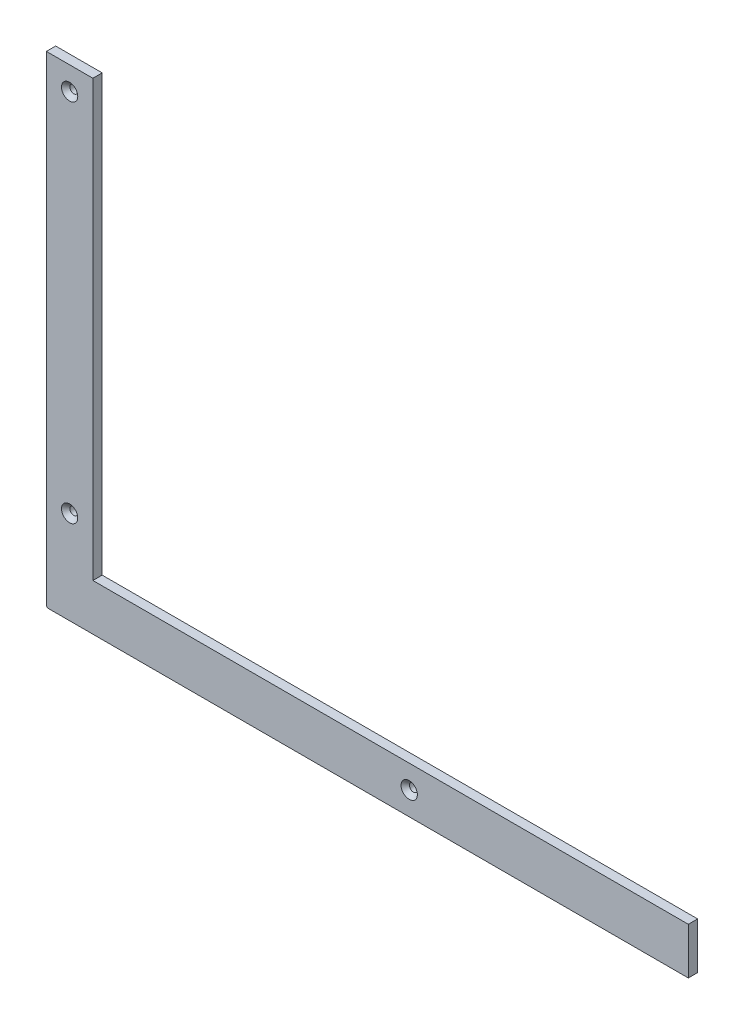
from build123d import *

# Parameters (mm, degrees)
SKIZZE1_W                                            = 532
SKIZZE1_H                                            = 394
SKIZZE1_W_2                                          = 492
SKIZZE1_H_2                                          = 354
AUFSATZ_LINEAR_AUSTRAGEN1_DEPTH                      = 8
VERRUNDUNG1_R                                        = 1
SKIZZE2_W                                            = 517
SKIZZE2_H                                            = 379
SCHNITT_LINEAR_AUSTRAGEN1_DEPTH                      = 4
FORMSENKUNG_F_R_M3_SENKSCHRAUBE_MIT_INNE_D           = 3.4
FORMSENKUNG_F_R_M3_SENKSCHRAUBE_MIT_INNE_CSINK_D     = 7
FORMSENKUNG_F_R_M3_SENKSCHRAUBE_MIT_INNE_CSINK_ANGLE = 90
SCHNITT_LINEAR_AUSTRAGEN2_DEPTH                      = 332.1027031
SCHNITT_LINEAR_AUSTRAGEN3_DEPTH                      = 332.1027031
SCHNITT_LINEAR_AUSTRAGEN4_DEPTH                      = 332.1027031
SCHNITT_LINEAR_AUSTRAGEN4_DEPTH_BACK                 = 332.1027031


with BuildPart() as part:
    # Skizze1 → Aufsatz-Linear austragen1 (new body)
    with BuildSketch(Plane.XY):
        Rectangle(SKIZZE1_W, SKIZZE1_H)
        Rectangle(SKIZZE1_W_2, SKIZZE1_H_2, mode=Mode.SUBTRACT)
    extrude(amount=AUFSATZ_LINEAR_AUSTRAGEN1_DEPTH)

    # Verrundung1
    verrundung1_edges = [part.edges().sort_by_distance(p)[0] for p in [
        (266, -197, 4),
        (-266, -197, 4),
        (-266, 197, 4),
        (266, 197, 4),
    ]]
    fillet(verrundung1_edges, radius=VERRUNDUNG1_R)

    # Skizze2 → Schnitt-Linear austragen1 (cut)
    with BuildSketch(Plane(origin=(0, 0, 0), x_dir=(-1, 0, 0), z_dir=(0, 0, -1))):
        Rectangle(SKIZZE2_W, SKIZZE2_H)
    extrude(amount=-SCHNITT_LINEAR_AUSTRAGEN1_DEPTH, mode=Mode.SUBTRACT)

    # Formsenkung f_r M3 Senkschraube mit Inne (through all)
    with Locations(Plane.XY.offset(8)):
        with Locations((-110, -187), (110, -187), (110, 187), (-110, 187), (256, 157), (256, -157), (-256, -157), (-256, 157), (-256, 0), (256, 0)):
            CounterSinkHole(FORMSENKUNG_F_R_M3_SENKSCHRAUBE_MIT_INNE_D / 2, FORMSENKUNG_F_R_M3_SENKSCHRAUBE_MIT_INNE_CSINK_D / 2, counter_sink_angle=FORMSENKUNG_F_R_M3_SENKSCHRAUBE_MIT_INNE_CSINK_ANGLE)

    # Skizze5 → Schnitt-Linear austragen2 (cut, through all)
    with BuildSketch(Plane(origin=(0, 0, 0), x_dir=(0, 0, -1), z_dir=(1, 0, 0))):
        Polygon((-8, 197), (-8, 10), (-4, 10), (-4, -10), (0, -10), (0, 197), align=None)
    extrude(amount=-SCHNITT_LINEAR_AUSTRAGEN2_DEPTH, mode=Mode.SUBTRACT)

    # Skizze6 → Schnitt-Linear austragen3 (cut, through all)
    with BuildSketch(Plane(origin=(0, 0, 0), x_dir=(0, 0, -1), z_dir=(1, 0, 0))):
        Polygon((-8, 197), (-8, -10), (-4, -10), (-4, 10), (0, 10), (0, 197), align=None)
    extrude(amount=SCHNITT_LINEAR_AUSTRAGEN3_DEPTH, mode=Mode.SUBTRACT)

    # Skizze7 → Schnitt-Linear austragen4 (cut, two sides: drawn at the far end of the back side and taken through both)
    with BuildSketch(Plane(origin=(0, 0, 0), x_dir=(1, 0, 0), z_dir=(0, 1, 0)).offset(-SCHNITT_LINEAR_AUSTRAGEN4_DEPTH_BACK)):
        Polygon((266, -8), (10, -8), (10, -4), (-10, -4), (-10, 0), (266, 0), align=None)
    extrude(amount=SCHNITT_LINEAR_AUSTRAGEN4_DEPTH + SCHNITT_LINEAR_AUSTRAGEN4_DEPTH_BACK, mode=Mode.SUBTRACT)


solid = part.part
